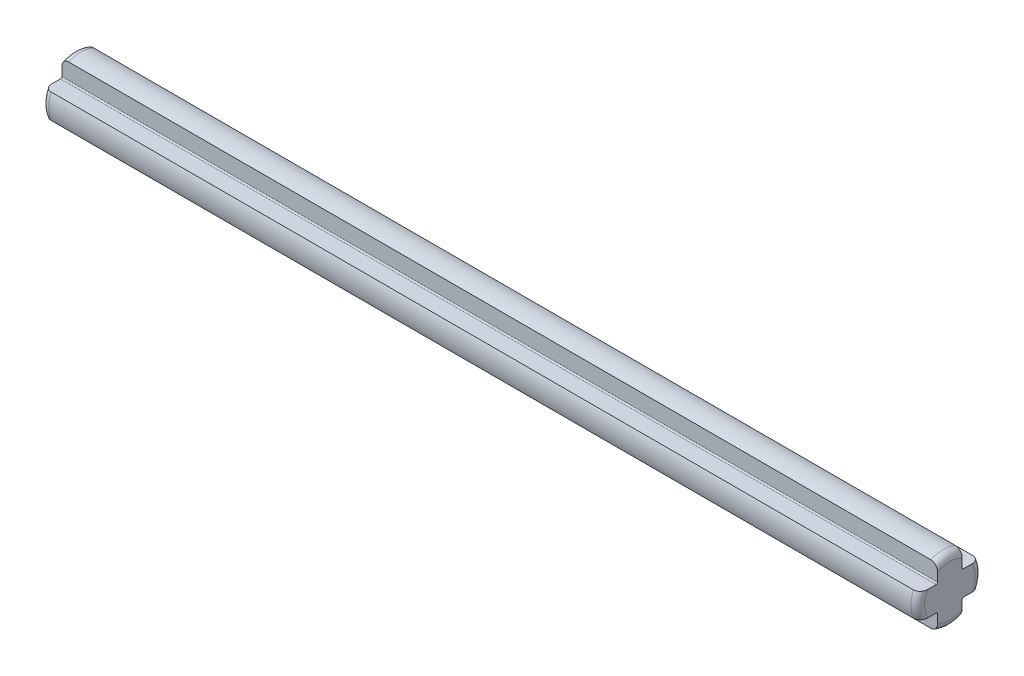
from build123d import *

# Parameters (mm, degrees)
EXTRUIR1_DEPTH = 32
REDONDEO1_R    = 0.5


with BuildPart() as part:
    # Croquis1 → Extruir1 (new, symmetric)
    with BuildSketch(Plane(origin=(0, 0, 0), x_dir=(0, 0, -1), z_dir=(1, 0, 0))):
        with BuildLine():
            Line((-0.9, 2.170829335), (-0.9, 1))
            ThreePointArc((-0.9, 1), (-0.929289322, 0.929289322), (-1, 0.9))
            Line((-1, 0.9), (-2.170829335, 0.9))
            ThreePointArc((-2.170829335, 0.9), (-2.35, 0), (-2.170829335, -0.9))
            Line((-2.170829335, -0.9), (-1, -0.9))
            ThreePointArc((-1, -0.9), (-0.929289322, -0.929289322), (-0.9, -1))
            Line((-0.9, -1), (-0.9, -2.170829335))
            ThreePointArc((-0.9, -2.170829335), (0, -2.35), (0.9, -2.170829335))
            Line((0.9, -2.170829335), (0.9, -1))
            ThreePointArc((0.9, -1), (0.929289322, -0.929289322), (1, -0.9))
            Line((1, -0.9), (2.170829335, -0.9))
            ThreePointArc((2.170829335, -0.9), (2.35, 0), (2.170829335, 0.9))
            Line((2.170829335, 0.9), (1, 0.9))
            ThreePointArc((1, 0.9), (0.929289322, 0.929289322), (0.9, 1))
            Line((0.9, 1), (0.9, 2.170829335))
            ThreePointArc((0.9, 2.170829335), (0, 2.35), (-0.9, 2.170829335))
        make_face()
    extrude(amount=EXTRUIR1_DEPTH, both=True)

    # Redondeo1
    redondeo1_edges = [part.edges().sort_by_distance(p)[0] for p in [
        (-32, 2.35, 0),
        (32, -2.35, 0),
        (-32, 0, -2.35),
        (-32, -2.35, 0),
        (-32, 0, 2.35),
        (32, 0, -2.35),
        (32, 0, 2.35),
        (32, 2.35, 0),
    ]]
    fillet(redondeo1_edges, radius=REDONDEO1_R)


solid = part.part
